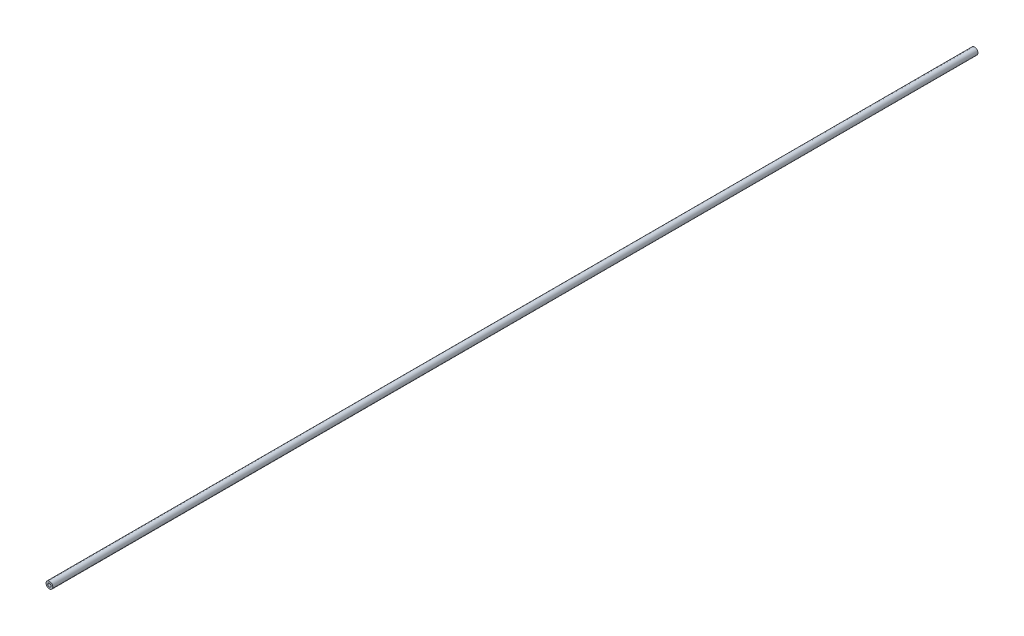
ISO-10303-21;
HEADER;
FILE_DESCRIPTION(('STEP AP214'),'2;1');
FILE_NAME('part.step','',(''),(''),'','','');
FILE_SCHEMA(('AUTOMOTIVE_DESIGN { 1 0 10303 214 1 1 1 1 }'));
ENDSEC;
DATA;
#1=APPLICATION_CONTEXT('core data for automotive mechanical design processes');
#2=APPLICATION_PROTOCOL_DEFINITION('international standard','automotive_design',2000,#1);
#3=PRODUCT_CONTEXT('',#1,'mechanical');
#4=PRODUCT('Part','Part','',(#3));
#5=PRODUCT_RELATED_PRODUCT_CATEGORY('part','',(#4));
#6=PRODUCT_DEFINITION_FORMATION('','',#4);
#7=PRODUCT_DEFINITION_CONTEXT('part definition',#1,'design');
#8=PRODUCT_DEFINITION('design','',#6,#7);
#9=PRODUCT_DEFINITION_SHAPE('','',#8);
#10=(LENGTH_UNIT() NAMED_UNIT(*) SI_UNIT(.MILLI.,.METRE.));
#11=(NAMED_UNIT(*) PLANE_ANGLE_UNIT() SI_UNIT($,.RADIAN.));
#12=(NAMED_UNIT(*) SI_UNIT($,.STERADIAN.) SOLID_ANGLE_UNIT());
#13=UNCERTAINTY_MEASURE_WITH_UNIT(LENGTH_MEASURE(1.E-05),#10,'distance_accuracy_value','');
#14=(GEOMETRIC_REPRESENTATION_CONTEXT(3) GLOBAL_UNCERTAINTY_ASSIGNED_CONTEXT((#13)) GLOBAL_UNIT_ASSIGNED_CONTEXT((#10,
#11,#12)) REPRESENTATION_CONTEXT('',''));
#15=CARTESIAN_POINT('',(0.,0.,0.));
#16=DIRECTION('',(0.,0.,1.));
#17=DIRECTION('',(1.,0.,0.));
#18=AXIS2_PLACEMENT_3D('',#15,#16,#17);
#19=CARTESIAN_POINT('',(0.,0.,450.));
#20=DIRECTION('',(0.,0.,1.));
#21=DIRECTION('',(1.,0.,0.));
#22=AXIS2_PLACEMENT_3D('',#19,#20,#21);
#23=PLANE('',#22);
#24=CARTESIAN_POINT('',(0.,0.,450.));
#25=DIRECTION('',(0.,0.,1.));
#26=DIRECTION('',(1.,0.,0.));
#27=AXIS2_PLACEMENT_3D('',#24,#25,#26);
#28=CIRCLE('',#27,1.65);
#29=CARTESIAN_POINT('',(1.65,0.,450.));
#30=VERTEX_POINT('',#29);
#31=EDGE_CURVE('E10',#30,#30,#28,.T.);
#32=ORIENTED_EDGE('',*,*,#31,.T.);
#33=EDGE_LOOP('',(#32));
#34=FACE_BOUND('',#33,.T.);
#35=CARTESIAN_POINT('',(0.,0.,450.));
#36=DIRECTION('',(0.,0.,1.));
#37=DIRECTION('',(1.,0.,0.));
#38=AXIS2_PLACEMENT_3D('',#35,#36,#37);
#39=CIRCLE('',#38,0.8);
#40=CARTESIAN_POINT('',(0.8,0.,450.));
#41=VERTEX_POINT('',#40);
#42=EDGE_CURVE('E44',#41,#41,#39,.T.);
#43=ORIENTED_EDGE('',*,*,#42,.F.);
#44=EDGE_LOOP('',(#43));
#45=FACE_BOUND('',#44,.T.);
#46=ADVANCED_FACE('F33',(#34,#45),#23,.T.);
#47=CARTESIAN_POINT('',(0.,0.,0.));
#48=DIRECTION('',(0.,0.,1.));
#49=DIRECTION('',(1.,0.,0.));
#50=AXIS2_PLACEMENT_3D('',#47,#48,#49);
#51=PLANE('',#50);
#52=CARTESIAN_POINT('',(0.,0.,0.));
#53=DIRECTION('',(0.,0.,1.));
#54=DIRECTION('',(1.,0.,0.));
#55=AXIS2_PLACEMENT_3D('',#52,#53,#54);
#56=CIRCLE('',#55,1.65);
#57=CARTESIAN_POINT('',(1.65,0.,0.));
#58=VERTEX_POINT('',#57);
#59=EDGE_CURVE('E37',#58,#58,#56,.T.);
#60=ORIENTED_EDGE('',*,*,#59,.F.);
#61=EDGE_LOOP('',(#60));
#62=FACE_BOUND('',#61,.T.);
#63=CARTESIAN_POINT('',(0.,0.,0.));
#64=DIRECTION('',(0.,0.,1.));
#65=DIRECTION('',(1.,0.,0.));
#66=AXIS2_PLACEMENT_3D('',#63,#64,#65);
#67=CIRCLE('',#66,0.8);
#68=CARTESIAN_POINT('',(0.8,0.,0.));
#69=VERTEX_POINT('',#68);
#70=EDGE_CURVE('E46',#69,#69,#67,.T.);
#71=ORIENTED_EDGE('',*,*,#70,.T.);
#72=EDGE_LOOP('',(#71));
#73=FACE_BOUND('',#72,.T.);
#74=ADVANCED_FACE('F56',(#62,#73),#51,.F.);
#75=CARTESIAN_POINT('',(0.,0.,450.));
#76=DIRECTION('',(0.,0.,-1.));
#77=DIRECTION('',(-1.,0.,0.));
#78=AXIS2_PLACEMENT_3D('',#75,#76,#77);
#79=CYLINDRICAL_SURFACE('',#78,1.65);
#80=ORIENTED_EDGE('',*,*,#31,.F.);
#81=EDGE_LOOP('',(#80));
#82=FACE_BOUND('',#81,.T.);
#83=ORIENTED_EDGE('',*,*,#59,.T.);
#84=EDGE_LOOP('',(#83));
#85=FACE_BOUND('',#84,.T.);
#86=ADVANCED_FACE('F35',(#82,#85),#79,.T.);
#87=CARTESIAN_POINT('',(0.,0.,450.));
#88=DIRECTION('',(0.,0.,-1.));
#89=DIRECTION('',(-1.,0.,0.));
#90=AXIS2_PLACEMENT_3D('',#87,#88,#89);
#91=CYLINDRICAL_SURFACE('',#90,0.8);
#92=ORIENTED_EDGE('',*,*,#42,.T.);
#93=EDGE_LOOP('',(#92));
#94=FACE_BOUND('',#93,.T.);
#95=ORIENTED_EDGE('',*,*,#70,.F.);
#96=EDGE_LOOP('',(#95));
#97=FACE_BOUND('',#96,.T.);
#98=ADVANCED_FACE('F52',(#94,#97),#91,.F.);
#99=CLOSED_SHELL('',(#46,#74,#86,#98));
#100=MANIFOLD_SOLID_BREP('B2',#99);
#101=ADVANCED_BREP_SHAPE_REPRESENTATION('',(#18,#100),#14);
#102=SHAPE_DEFINITION_REPRESENTATION(#9,#101);
ENDSEC;
END-ISO-10303-21;
